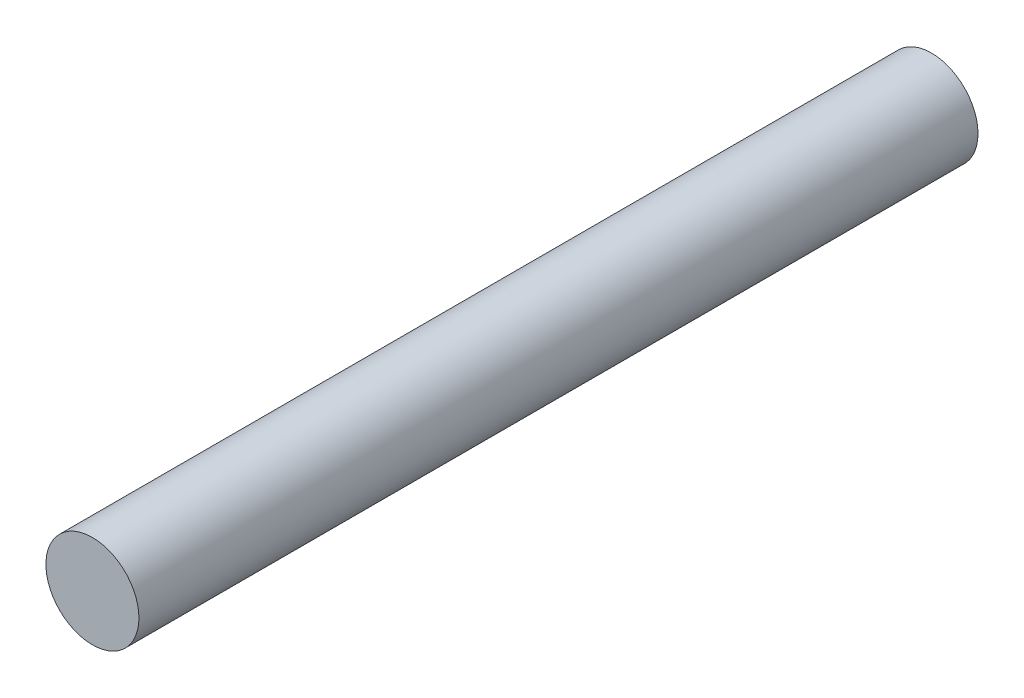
ISO-10303-21;
HEADER;
FILE_DESCRIPTION(('STEP AP214'),'2;1');
FILE_NAME('part.step','',(''),(''),'','','');
FILE_SCHEMA(('AUTOMOTIVE_DESIGN { 1 0 10303 214 1 1 1 1 }'));
ENDSEC;
DATA;
#1=APPLICATION_CONTEXT('core data for automotive mechanical design processes');
#2=APPLICATION_PROTOCOL_DEFINITION('international standard','automotive_design',2000,#1);
#3=PRODUCT_CONTEXT('',#1,'mechanical');
#4=PRODUCT('Part','Part','',(#3));
#5=PRODUCT_RELATED_PRODUCT_CATEGORY('part','',(#4));
#6=PRODUCT_DEFINITION_FORMATION('','',#4);
#7=PRODUCT_DEFINITION_CONTEXT('part definition',#1,'design');
#8=PRODUCT_DEFINITION('design','',#6,#7);
#9=PRODUCT_DEFINITION_SHAPE('','',#8);
#10=(LENGTH_UNIT() NAMED_UNIT(*) SI_UNIT(.MILLI.,.METRE.));
#11=(NAMED_UNIT(*) PLANE_ANGLE_UNIT() SI_UNIT($,.RADIAN.));
#12=(NAMED_UNIT(*) SI_UNIT($,.STERADIAN.) SOLID_ANGLE_UNIT());
#13=UNCERTAINTY_MEASURE_WITH_UNIT(LENGTH_MEASURE(1.E-05),#10,'distance_accuracy_value','');
#14=(GEOMETRIC_REPRESENTATION_CONTEXT(3) GLOBAL_UNCERTAINTY_ASSIGNED_CONTEXT((#13)) GLOBAL_UNIT_ASSIGNED_CONTEXT((#10,
#11,#12)) REPRESENTATION_CONTEXT('',''));
#15=CARTESIAN_POINT('',(0.,0.,0.));
#16=DIRECTION('',(0.,0.,1.));
#17=DIRECTION('',(1.,0.,0.));
#18=AXIS2_PLACEMENT_3D('',#15,#16,#17);
#19=CARTESIAN_POINT('',(0.,0.,11.684));
#20=DIRECTION('',(0.,0.,-1.));
#21=DIRECTION('',(-1.,0.,0.));
#22=AXIS2_PLACEMENT_3D('',#19,#20,#21);
#23=CYLINDRICAL_SURFACE('',#22,0.6477);
#24=CARTESIAN_POINT('',(0.,0.,11.684));
#25=DIRECTION('',(0.,0.,1.));
#26=DIRECTION('',(1.,0.,0.));
#27=AXIS2_PLACEMENT_3D('',#24,#25,#26);
#28=CIRCLE('',#27,0.6477);
#29=CARTESIAN_POINT('',(0.6477,0.,11.684));
#30=VERTEX_POINT('',#29);
#31=EDGE_CURVE('E10',#30,#30,#28,.T.);
#32=ORIENTED_EDGE('',*,*,#31,.F.);
#33=EDGE_LOOP('',(#32));
#34=FACE_BOUND('',#33,.T.);
#35=CARTESIAN_POINT('',(0.,0.,0.));
#36=DIRECTION('',(0.,0.,1.));
#37=DIRECTION('',(1.,0.,0.));
#38=AXIS2_PLACEMENT_3D('',#35,#36,#37);
#39=CIRCLE('',#38,0.6477);
#40=CARTESIAN_POINT('',(0.6477,0.,0.));
#41=VERTEX_POINT('',#40);
#42=EDGE_CURVE('E35',#41,#41,#39,.T.);
#43=ORIENTED_EDGE('',*,*,#42,.T.);
#44=EDGE_LOOP('',(#43));
#45=FACE_BOUND('',#44,.T.);
#46=ADVANCED_FACE('F32',(#34,#45),#23,.T.);
#47=CARTESIAN_POINT('',(0.,0.,11.684));
#48=DIRECTION('',(0.,0.,1.));
#49=DIRECTION('',(1.,0.,0.));
#50=AXIS2_PLACEMENT_3D('',#47,#48,#49);
#51=PLANE('',#50);
#52=ORIENTED_EDGE('',*,*,#31,.T.);
#53=EDGE_LOOP('',(#52));
#54=FACE_BOUND('',#53,.T.);
#55=ADVANCED_FACE('F47',(#54),#51,.T.);
#56=CARTESIAN_POINT('',(0.,0.,0.));
#57=DIRECTION('',(0.,0.,1.));
#58=DIRECTION('',(1.,0.,0.));
#59=AXIS2_PLACEMENT_3D('',#56,#57,#58);
#60=PLANE('',#59);
#61=ORIENTED_EDGE('',*,*,#42,.F.);
#62=EDGE_LOOP('',(#61));
#63=FACE_BOUND('',#62,.T.);
#64=ADVANCED_FACE('F45',(#63),#60,.F.);
#65=CLOSED_SHELL('',(#46,#55,#64));
#66=MANIFOLD_SOLID_BREP('B2',#65);
#67=ADVANCED_BREP_SHAPE_REPRESENTATION('',(#18,#66),#14);
#68=SHAPE_DEFINITION_REPRESENTATION(#9,#67);
ENDSEC;
END-ISO-10303-21;
